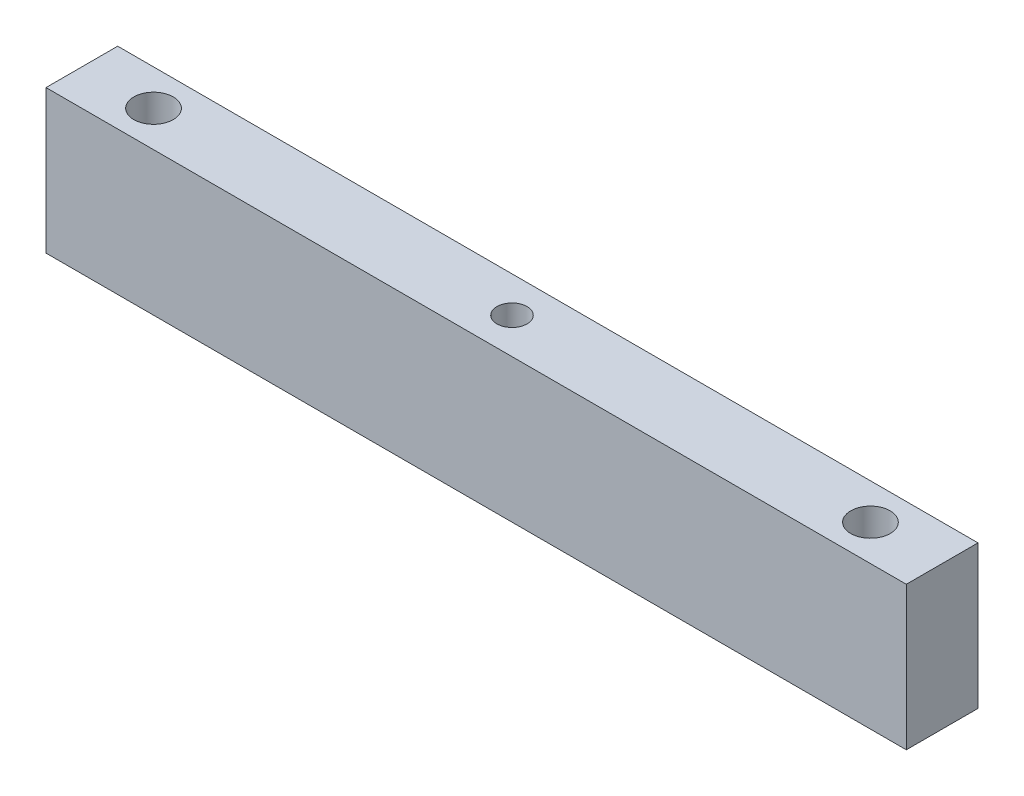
ISO-10303-21;
HEADER;
FILE_DESCRIPTION(('STEP AP214'),'2;1');
FILE_NAME('part.step','',(''),(''),'','','');
FILE_SCHEMA(('AUTOMOTIVE_DESIGN { 1 0 10303 214 1 1 1 1 }'));
ENDSEC;
DATA;
#1=APPLICATION_CONTEXT('core data for automotive mechanical design processes');
#2=APPLICATION_PROTOCOL_DEFINITION('international standard','automotive_design',2000,#1);
#3=PRODUCT_CONTEXT('',#1,'mechanical');
#4=PRODUCT('Part','Part','',(#3));
#5=PRODUCT_RELATED_PRODUCT_CATEGORY('part','',(#4));
#6=PRODUCT_DEFINITION_FORMATION('','',#4);
#7=PRODUCT_DEFINITION_CONTEXT('part definition',#1,'design');
#8=PRODUCT_DEFINITION('design','',#6,#7);
#9=PRODUCT_DEFINITION_SHAPE('','',#8);
#10=(LENGTH_UNIT() NAMED_UNIT(*) SI_UNIT(.MILLI.,.METRE.));
#11=(NAMED_UNIT(*) PLANE_ANGLE_UNIT() SI_UNIT($,.RADIAN.));
#12=(NAMED_UNIT(*) SI_UNIT($,.STERADIAN.) SOLID_ANGLE_UNIT());
#13=UNCERTAINTY_MEASURE_WITH_UNIT(LENGTH_MEASURE(1.E-05),#10,'distance_accuracy_value','');
#14=(GEOMETRIC_REPRESENTATION_CONTEXT(3) GLOBAL_UNCERTAINTY_ASSIGNED_CONTEXT((#13)) GLOBAL_UNIT_ASSIGNED_CONTEXT((#10,
#11,#12)) REPRESENTATION_CONTEXT('',''));
#15=CARTESIAN_POINT('',(0.,0.,0.));
#16=DIRECTION('',(0.,0.,1.));
#17=DIRECTION('',(1.,0.,0.));
#18=AXIS2_PLACEMENT_3D('',#15,#16,#17);
#19=CARTESIAN_POINT('',(-60.,9.99999999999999,10.));
#20=DIRECTION('',(1.,0.,0.));
#21=DIRECTION('',(0.,1.,0.));
#22=AXIS2_PLACEMENT_3D('',#19,#20,#21);
#23=PLANE('',#22);
#24=DIRECTION('',(0.,-1.,0.));
#25=VECTOR('',#24,1.);
#26=CARTESIAN_POINT('',(-60.,9.99999999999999,0.));
#27=LINE('',#26,#25);
#28=CARTESIAN_POINT('',(-60.,9.99999999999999,0.));
#29=VERTEX_POINT('',#28);
#30=CARTESIAN_POINT('',(-60.,-10.,0.));
#31=VERTEX_POINT('',#30);
#32=EDGE_CURVE('E100',#29,#31,#27,.T.);
#33=ORIENTED_EDGE('',*,*,#32,.T.);
#34=DIRECTION('',(0.,0.,-1.));
#35=VECTOR('',#34,1.);
#36=CARTESIAN_POINT('',(-60.,-10.,10.));
#37=LINE('',#36,#35);
#38=CARTESIAN_POINT('',(-60.,-10.,10.));
#39=VERTEX_POINT('',#38);
#40=EDGE_CURVE('E11',#39,#31,#37,.T.);
#41=ORIENTED_EDGE('',*,*,#40,.F.);
#42=DIRECTION('',(0.,-1.,0.));
#43=VECTOR('',#42,1.);
#44=CARTESIAN_POINT('',(-60.,9.99999999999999,10.));
#45=LINE('',#44,#43);
#46=CARTESIAN_POINT('',(-60.,9.99999999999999,10.));
#47=VERTEX_POINT('',#46);
#48=EDGE_CURVE('E88',#47,#39,#45,.T.);
#49=ORIENTED_EDGE('',*,*,#48,.F.);
#50=DIRECTION('',(0.,0.,-1.));
#51=VECTOR('',#50,1.);
#52=CARTESIAN_POINT('',(-60.,9.99999999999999,10.));
#53=LINE('',#52,#51);
#54=EDGE_CURVE('E96',#47,#29,#53,.T.);
#55=ORIENTED_EDGE('',*,*,#54,.T.);
#56=EDGE_LOOP('',(#33,#41,#49,#55));
#57=FACE_BOUND('',#56,.T.);
#58=ADVANCED_FACE('F37',(#57),#23,.F.);
#59=CARTESIAN_POINT('',(60.,-10.,10.));
#60=DIRECTION('',(0.,1.,0.));
#61=DIRECTION('',(-1.,0.,0.));
#62=AXIS2_PLACEMENT_3D('',#59,#60,#61);
#63=PLANE('',#62);
#64=CARTESIAN_POINT('',(0.,-10.,5.));
#65=DIRECTION('',(0.,1.,0.));
#66=DIRECTION('',(0.,0.,1.));
#67=AXIS2_PLACEMENT_3D('',#64,#65,#66);
#68=CIRCLE('',#67,2.1);
#69=CARTESIAN_POINT('',(0.,-10.,7.1));
#70=VERTEX_POINT('',#69);
#71=EDGE_CURVE('E125',#70,#70,#68,.T.);
#72=ORIENTED_EDGE('',*,*,#71,.T.);
#73=EDGE_LOOP('',(#72));
#74=FACE_BOUND('',#73,.T.);
#75=CARTESIAN_POINT('',(-50.,-10.,5.));
#76=DIRECTION('',(0.,1.,0.));
#77=DIRECTION('',(0.,0.,1.));
#78=AXIS2_PLACEMENT_3D('',#75,#76,#77);
#79=CIRCLE('',#78,2.75);
#80=CARTESIAN_POINT('',(-50.,-10.,7.75));
#81=VERTEX_POINT('',#80);
#82=EDGE_CURVE('E119',#81,#81,#79,.T.);
#83=ORIENTED_EDGE('',*,*,#82,.T.);
#84=EDGE_LOOP('',(#83));
#85=FACE_BOUND('',#84,.T.);
#86=CARTESIAN_POINT('',(50.,-10.,5.));
#87=DIRECTION('',(0.,1.,0.));
#88=DIRECTION('',(0.,0.,1.));
#89=AXIS2_PLACEMENT_3D('',#86,#87,#88);
#90=CIRCLE('',#89,2.75);
#91=CARTESIAN_POINT('',(50.,-10.,7.75));
#92=VERTEX_POINT('',#91);
#93=EDGE_CURVE('E103',#92,#92,#90,.T.);
#94=ORIENTED_EDGE('',*,*,#93,.T.);
#95=EDGE_LOOP('',(#94));
#96=FACE_BOUND('',#95,.T.);
#97=DIRECTION('',(1.,0.,0.));
#98=VECTOR('',#97,1.);
#99=CARTESIAN_POINT('',(60.,-10.,0.));
#100=LINE('',#99,#98);
#101=CARTESIAN_POINT('',(60.,-10.,0.));
#102=VERTEX_POINT('',#101);
#103=EDGE_CURVE('E92',#31,#102,#100,.T.);
#104=ORIENTED_EDGE('',*,*,#103,.T.);
#105=DIRECTION('',(0.,0.,-1.));
#106=VECTOR('',#105,1.);
#107=CARTESIAN_POINT('',(60.,-10.,10.));
#108=LINE('',#107,#106);
#109=CARTESIAN_POINT('',(60.,-10.,10.));
#110=VERTEX_POINT('',#109);
#111=EDGE_CURVE('E45',#110,#102,#108,.T.);
#112=ORIENTED_EDGE('',*,*,#111,.F.);
#113=DIRECTION('',(1.,0.,0.));
#114=VECTOR('',#113,1.);
#115=CARTESIAN_POINT('',(60.,-10.,10.));
#116=LINE('',#115,#114);
#117=EDGE_CURVE('E83',#39,#110,#116,.T.);
#118=ORIENTED_EDGE('',*,*,#117,.F.);
#119=ORIENTED_EDGE('',*,*,#40,.T.);
#120=EDGE_LOOP('',(#104,#112,#118,#119));
#121=FACE_BOUND('',#120,.T.);
#122=ADVANCED_FACE('F91',(#74,#85,#96,#121),#63,.F.);
#123=CARTESIAN_POINT('',(60.,10.,10.));
#124=DIRECTION('',(-1.,0.,0.));
#125=DIRECTION('',(0.,0.,1.));
#126=AXIS2_PLACEMENT_3D('',#123,#124,#125);
#127=PLANE('',#126);
#128=DIRECTION('',(0.,1.,0.));
#129=VECTOR('',#128,1.);
#130=CARTESIAN_POINT('',(60.,10.,0.));
#131=LINE('',#130,#129);
#132=CARTESIAN_POINT('',(60.,10.,0.));
#133=VERTEX_POINT('',#132);
#134=EDGE_CURVE('E70',#102,#133,#131,.T.);
#135=ORIENTED_EDGE('',*,*,#134,.T.);
#136=DIRECTION('',(0.,0.,-1.));
#137=VECTOR('',#136,1.);
#138=CARTESIAN_POINT('',(60.,10.,10.));
#139=LINE('',#138,#137);
#140=CARTESIAN_POINT('',(60.,10.,10.));
#141=VERTEX_POINT('',#140);
#142=EDGE_CURVE('E93',#141,#133,#139,.T.);
#143=ORIENTED_EDGE('',*,*,#142,.F.);
#144=DIRECTION('',(0.,1.,0.));
#145=VECTOR('',#144,1.);
#146=CARTESIAN_POINT('',(60.,10.,10.));
#147=LINE('',#146,#145);
#148=EDGE_CURVE('E86',#110,#141,#147,.T.);
#149=ORIENTED_EDGE('',*,*,#148,.F.);
#150=ORIENTED_EDGE('',*,*,#111,.T.);
#151=EDGE_LOOP('',(#135,#143,#149,#150));
#152=FACE_BOUND('',#151,.T.);
#153=ADVANCED_FACE('F94',(#152),#127,.F.);
#154=CARTESIAN_POINT('',(60.,10.,10.));
#155=DIRECTION('',(0.,-1.,0.));
#156=DIRECTION('',(1.,0.,0.));
#157=AXIS2_PLACEMENT_3D('',#154,#155,#156);
#158=PLANE('',#157);
#159=CARTESIAN_POINT('',(0.,9.99999999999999,5.));
#160=DIRECTION('',(0.,1.,0.));
#161=DIRECTION('',(0.,0.,1.));
#162=AXIS2_PLACEMENT_3D('',#159,#160,#161);
#163=CIRCLE('',#162,2.1);
#164=CARTESIAN_POINT('',(0.,9.99999999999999,7.1));
#165=VERTEX_POINT('',#164);
#166=EDGE_CURVE('E128',#165,#165,#163,.T.);
#167=ORIENTED_EDGE('',*,*,#166,.F.);
#168=EDGE_LOOP('',(#167));
#169=FACE_BOUND('',#168,.T.);
#170=CARTESIAN_POINT('',(-50.,9.99999999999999,5.));
#171=DIRECTION('',(0.,1.,0.));
#172=DIRECTION('',(0.,0.,1.));
#173=AXIS2_PLACEMENT_3D('',#170,#171,#172);
#174=CIRCLE('',#173,2.75);
#175=CARTESIAN_POINT('',(-50.,9.99999999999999,7.75));
#176=VERTEX_POINT('',#175);
#177=EDGE_CURVE('E122',#176,#176,#174,.T.);
#178=ORIENTED_EDGE('',*,*,#177,.F.);
#179=EDGE_LOOP('',(#178));
#180=FACE_BOUND('',#179,.T.);
#181=CARTESIAN_POINT('',(50.,10.,5.));
#182=DIRECTION('',(0.,1.,0.));
#183=DIRECTION('',(0.,0.,1.));
#184=AXIS2_PLACEMENT_3D('',#181,#182,#183);
#185=CIRCLE('',#184,2.75);
#186=CARTESIAN_POINT('',(50.,10.,7.75));
#187=VERTEX_POINT('',#186);
#188=EDGE_CURVE('E116',#187,#187,#185,.T.);
#189=ORIENTED_EDGE('',*,*,#188,.F.);
#190=EDGE_LOOP('',(#189));
#191=FACE_BOUND('',#190,.T.);
#192=DIRECTION('',(-1.,0.,0.));
#193=VECTOR('',#192,1.);
#194=CARTESIAN_POINT('',(60.,10.,0.));
#195=LINE('',#194,#193);
#196=EDGE_CURVE('E76',#133,#29,#195,.T.);
#197=ORIENTED_EDGE('',*,*,#196,.T.);
#198=ORIENTED_EDGE('',*,*,#54,.F.);
#199=DIRECTION('',(-1.,0.,0.));
#200=VECTOR('',#199,1.);
#201=CARTESIAN_POINT('',(60.,10.,10.));
#202=LINE('',#201,#200);
#203=EDGE_CURVE('E53',#141,#47,#202,.T.);
#204=ORIENTED_EDGE('',*,*,#203,.F.);
#205=ORIENTED_EDGE('',*,*,#142,.T.);
#206=EDGE_LOOP('',(#197,#198,#204,#205));
#207=FACE_BOUND('',#206,.T.);
#208=ADVANCED_FACE('F108',(#169,#180,#191,#207),#158,.F.);
#209=CARTESIAN_POINT('',(0.,0.,10.));
#210=DIRECTION('',(0.,0.,-1.));
#211=DIRECTION('',(-1.,0.,0.));
#212=AXIS2_PLACEMENT_3D('',#209,#210,#211);
#213=PLANE('',#212);
#214=ORIENTED_EDGE('',*,*,#48,.T.);
#215=ORIENTED_EDGE('',*,*,#117,.T.);
#216=ORIENTED_EDGE('',*,*,#148,.T.);
#217=ORIENTED_EDGE('',*,*,#203,.T.);
#218=EDGE_LOOP('',(#214,#215,#216,#217));
#219=FACE_BOUND('',#218,.T.);
#220=ADVANCED_FACE('F84',(#219),#213,.F.);
#221=CARTESIAN_POINT('',(0.,0.,0.));
#222=DIRECTION('',(0.,0.,-1.));
#223=DIRECTION('',(-1.,0.,0.));
#224=AXIS2_PLACEMENT_3D('',#221,#222,#223);
#225=PLANE('',#224);
#226=ORIENTED_EDGE('',*,*,#32,.F.);
#227=ORIENTED_EDGE('',*,*,#196,.F.);
#228=ORIENTED_EDGE('',*,*,#134,.F.);
#229=ORIENTED_EDGE('',*,*,#103,.F.);
#230=EDGE_LOOP('',(#226,#227,#228,#229));
#231=FACE_BOUND('',#230,.T.);
#232=ADVANCED_FACE('F111',(#231),#225,.T.);
#233=CARTESIAN_POINT('',(50.,10.,5.));
#234=DIRECTION('',(0.,1.,0.));
#235=DIRECTION('',(0.,0.,1.));
#236=AXIS2_PLACEMENT_3D('',#233,#234,#235);
#237=CYLINDRICAL_SURFACE('',#236,2.75);
#238=ORIENTED_EDGE('',*,*,#93,.F.);
#239=EDGE_LOOP('',(#238));
#240=FACE_BOUND('',#239,.T.);
#241=ORIENTED_EDGE('',*,*,#188,.T.);
#242=EDGE_LOOP('',(#241));
#243=FACE_BOUND('',#242,.T.);
#244=ADVANCED_FACE('F141',(#240,#243),#237,.F.);
#245=CARTESIAN_POINT('',(-50.,9.99999999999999,5.));
#246=DIRECTION('',(0.,1.,0.));
#247=DIRECTION('',(0.,0.,1.));
#248=AXIS2_PLACEMENT_3D('',#245,#246,#247);
#249=CYLINDRICAL_SURFACE('',#248,2.75);
#250=ORIENTED_EDGE('',*,*,#82,.F.);
#251=EDGE_LOOP('',(#250));
#252=FACE_BOUND('',#251,.T.);
#253=ORIENTED_EDGE('',*,*,#177,.T.);
#254=EDGE_LOOP('',(#253));
#255=FACE_BOUND('',#254,.T.);
#256=ADVANCED_FACE('F143',(#252,#255),#249,.F.);
#257=CARTESIAN_POINT('',(0.,9.99999999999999,5.));
#258=DIRECTION('',(0.,1.,0.));
#259=DIRECTION('',(0.,0.,1.));
#260=AXIS2_PLACEMENT_3D('',#257,#258,#259);
#261=CYLINDRICAL_SURFACE('',#260,2.1);
#262=ORIENTED_EDGE('',*,*,#71,.F.);
#263=EDGE_LOOP('',(#262));
#264=FACE_BOUND('',#263,.T.);
#265=ORIENTED_EDGE('',*,*,#166,.T.);
#266=EDGE_LOOP('',(#265));
#267=FACE_BOUND('',#266,.T.);
#268=ADVANCED_FACE('F132',(#264,#267),#261,.F.);
#269=CLOSED_SHELL('',(#58,#122,#153,#208,#220,#232,#244,#256,#268));
#270=MANIFOLD_SOLID_BREP('B2',#269);
#271=ADVANCED_BREP_SHAPE_REPRESENTATION('',(#18,#270),#14);
#272=SHAPE_DEFINITION_REPRESENTATION(#9,#271);
ENDSEC;
END-ISO-10303-21;
